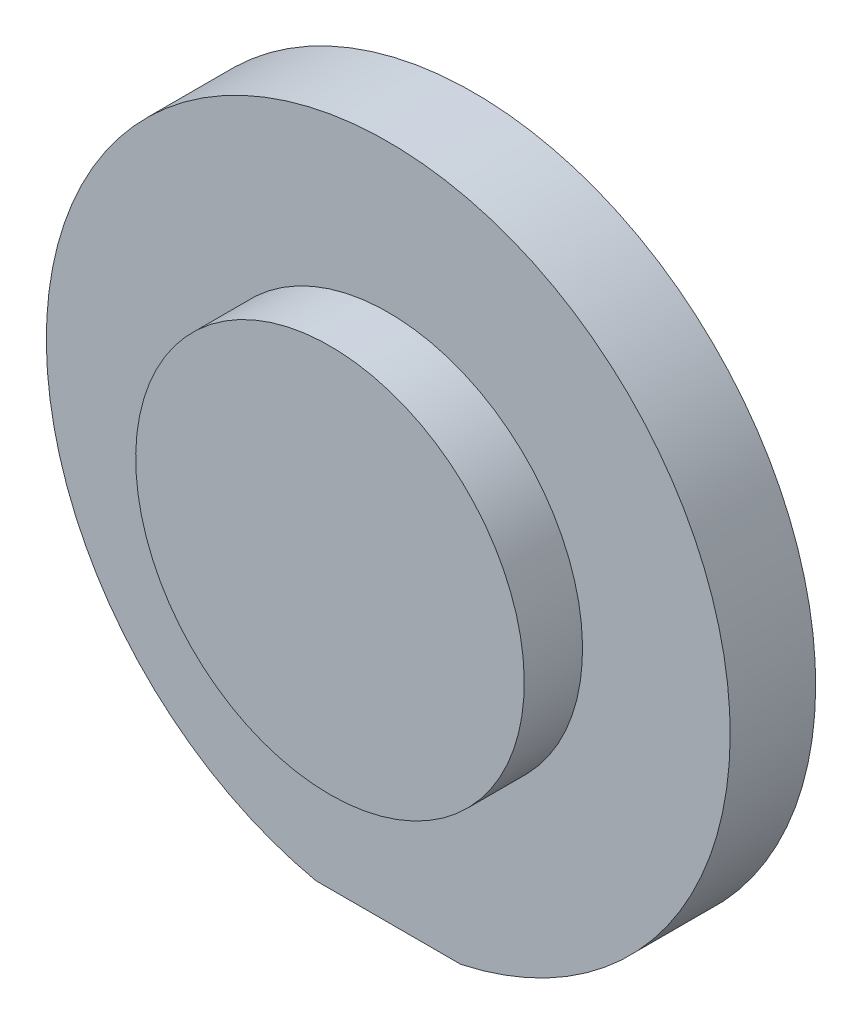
ISO-10303-21;
HEADER;
FILE_DESCRIPTION(('STEP AP214'),'2;1');
FILE_NAME('part.step','',(''),(''),'','','');
FILE_SCHEMA(('AUTOMOTIVE_DESIGN { 1 0 10303 214 1 1 1 1 }'));
ENDSEC;
DATA;
#1=APPLICATION_CONTEXT('core data for automotive mechanical design processes');
#2=APPLICATION_PROTOCOL_DEFINITION('international standard','automotive_design',2000,#1);
#3=PRODUCT_CONTEXT('',#1,'mechanical');
#4=PRODUCT('Part','Part','',(#3));
#5=PRODUCT_RELATED_PRODUCT_CATEGORY('part','',(#4));
#6=PRODUCT_DEFINITION_FORMATION('','',#4);
#7=PRODUCT_DEFINITION_CONTEXT('part definition',#1,'design');
#8=PRODUCT_DEFINITION('design','',#6,#7);
#9=PRODUCT_DEFINITION_SHAPE('','',#8);
#10=(LENGTH_UNIT() NAMED_UNIT(*) SI_UNIT(.MILLI.,.METRE.));
#11=(NAMED_UNIT(*) PLANE_ANGLE_UNIT() SI_UNIT($,.RADIAN.));
#12=(NAMED_UNIT(*) SI_UNIT($,.STERADIAN.) SOLID_ANGLE_UNIT());
#13=UNCERTAINTY_MEASURE_WITH_UNIT(LENGTH_MEASURE(1.E-05),#10,'distance_accuracy_value','');
#14=(GEOMETRIC_REPRESENTATION_CONTEXT(3) GLOBAL_UNCERTAINTY_ASSIGNED_CONTEXT((#13)) GLOBAL_UNIT_ASSIGNED_CONTEXT((#10,
#11,#12)) REPRESENTATION_CONTEXT('',''));
#15=CARTESIAN_POINT('',(0.,0.,0.));
#16=DIRECTION('',(0.,0.,1.));
#17=DIRECTION('',(1.,0.,0.));
#18=AXIS2_PLACEMENT_3D('',#15,#16,#17);
#19=CARTESIAN_POINT('',(2.27373675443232E-13,1.24761854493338E-13,-4.54747350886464E-13));
#20=DIRECTION('',(0.,0.,-1.));
#21=DIRECTION('',(0.,1.,0.));
#22=AXIS2_PLACEMENT_3D('',#19,#20,#21);
#23=PLANE('',#22);
#24=CARTESIAN_POINT('',(2.2903900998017E-13,1.24761854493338E-13,-4.55364912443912E-13));
#25=DIRECTION('',(0.,0.,1.));
#26=DIRECTION('',(0.,-1.,0.));
#27=AXIS2_PLACEMENT_3D('',#24,#25,#26);
#28=CIRCLE('',#27,25.);
#29=CARTESIAN_POINT('',(2.2903900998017E-13,-24.9999999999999,-4.41201166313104E-13));
#30=VERTEX_POINT('',#29);
#31=EDGE_CURVE('E19',#30,#30,#28,.F.);
#32=ORIENTED_EDGE('',*,*,#31,.F.);
#33=EDGE_LOOP('',(#32));
#34=FACE_BOUND('',#33,.T.);
#35=ADVANCED_FACE('F16',(#34),#23,.F.);
#36=CARTESIAN_POINT('',(2.27373675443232E-13,1.20512730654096E-13,-7.50000000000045));
#37=DIRECTION('',(0.,0.,1.));
#38=DIRECTION('',(0.,-1.,0.));
#39=AXIS2_PLACEMENT_3D('',#36,#37,#38);
#40=CYLINDRICAL_SURFACE('',#39,25.);
#41=ORIENTED_EDGE('',*,*,#31,.T.);
#42=EDGE_LOOP('',(#41));
#43=FACE_BOUND('',#42,.T.);
#44=CARTESIAN_POINT('',(2.27373675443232E-13,1.20512730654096E-13,-7.50000000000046));
#45=DIRECTION('',(0.,0.,1.));
#46=DIRECTION('',(0.,-1.,0.));
#47=AXIS2_PLACEMENT_3D('',#44,#45,#46);
#48=CIRCLE('',#47,25.);
#49=CARTESIAN_POINT('',(2.27373675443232E-13,-24.9999999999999,-7.50000000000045));
#50=VERTEX_POINT('',#49);
#51=EDGE_CURVE('E50',#50,#50,#48,.F.);
#52=ORIENTED_EDGE('',*,*,#51,.F.);
#53=EDGE_LOOP('',(#52));
#54=FACE_BOUND('',#53,.T.);
#55=ADVANCED_FACE('F64',(#43,#54),#40,.T.);
#56=CARTESIAN_POINT('',(2.27373675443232E-13,-3.92533270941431,-7.50000000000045));
#57=DIRECTION('',(0.,0.,1.));
#58=DIRECTION('',(0.,-1.,0.));
#59=AXIS2_PLACEMENT_3D('',#56,#57,#58);
#60=PLANE('',#59);
#61=CARTESIAN_POINT('',(2.29816166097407E-13,1.20512730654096E-13,-7.50000000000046));
#62=DIRECTION('',(0.,0.,1.));
#63=DIRECTION('',(0.,-1.,0.));
#64=AXIS2_PLACEMENT_3D('',#61,#62,#63);
#65=CIRCLE('',#64,44.);
#66=CARTESIAN_POINT('',(-9.32737905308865,-42.9999999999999,-7.50000000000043));
#67=VERTEX_POINT('',#66);
#68=CARTESIAN_POINT('',(9.3273790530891,-42.9999999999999,-7.50000000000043));
#69=VERTEX_POINT('',#68);
#70=EDGE_CURVE('E45',#67,#69,#65,.F.);
#71=ORIENTED_EDGE('',*,*,#70,.F.);
#72=DIRECTION('',(1.,0.,0.));
#73=VECTOR('',#72,1.);
#74=CARTESIAN_POINT('',(9.32737905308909,-42.9999999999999,-7.50000000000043));
#75=LINE('',#74,#73);
#76=EDGE_CURVE('E40',#69,#67,#75,.F.);
#77=ORIENTED_EDGE('',*,*,#76,.F.);
#78=EDGE_LOOP('',(#71,#77));
#79=FACE_BOUND('',#78,.T.);
#80=ORIENTED_EDGE('',*,*,#51,.T.);
#81=EDGE_LOOP('',(#80));
#82=FACE_BOUND('',#81,.T.);
#83=ADVANCED_FACE('F54',(#79,#82),#60,.T.);
#84=CARTESIAN_POINT('',(2.27373675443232E-13,1.1428068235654E-13,-18.5000000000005));
#85=DIRECTION('',(0.,0.,1.));
#86=DIRECTION('',(0.,-1.,0.));
#87=AXIS2_PLACEMENT_3D('',#84,#85,#86);
#88=CYLINDRICAL_SURFACE('',#87,44.);
#89=CARTESIAN_POINT('',(2.27373675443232E-13,1.1428068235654E-13,-18.5000000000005));
#90=DIRECTION('',(0.,0.,1.));
#91=DIRECTION('',(0.,-1.,0.));
#92=AXIS2_PLACEMENT_3D('',#89,#90,#91);
#93=CIRCLE('',#92,44.);
#94=CARTESIAN_POINT('',(9.3273790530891,-42.9999999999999,-18.5000000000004));
#95=VERTEX_POINT('',#94);
#96=CARTESIAN_POINT('',(-9.32737905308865,-42.9999999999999,-18.5000000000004));
#97=VERTEX_POINT('',#96);
#98=EDGE_CURVE('E25',#95,#97,#93,.T.);
#99=ORIENTED_EDGE('',*,*,#98,.T.);
#100=DIRECTION('',(0.,0.,-1.));
#101=VECTOR('',#100,1.);
#102=CARTESIAN_POINT('',(-9.32737905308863,-42.9999999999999,-18.5000000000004));
#103=LINE('',#102,#101);
#104=EDGE_CURVE('E33',#67,#97,#103,.T.);
#105=ORIENTED_EDGE('',*,*,#104,.F.);
#106=ORIENTED_EDGE('',*,*,#70,.T.);
#107=DIRECTION('',(0.,0.,-1.));
#108=VECTOR('',#107,1.);
#109=CARTESIAN_POINT('',(9.32737905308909,-42.9999999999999,-18.5000000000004));
#110=LINE('',#109,#108);
#111=EDGE_CURVE('E48',#95,#69,#110,.F.);
#112=ORIENTED_EDGE('',*,*,#111,.F.);
#113=EDGE_LOOP('',(#99,#105,#106,#112));
#114=FACE_BOUND('',#113,.T.);
#115=ADVANCED_FACE('F47',(#114),#88,.T.);
#116=CARTESIAN_POINT('',(9.32737905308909,-42.9999999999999,-18.5000000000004));
#117=DIRECTION('',(0.,-1.,0.));
#118=DIRECTION('',(0.,0.,-1.));
#119=AXIS2_PLACEMENT_3D('',#116,#117,#118);
#120=PLANE('',#119);
#121=DIRECTION('',(1.,0.,0.));
#122=VECTOR('',#121,1.);
#123=CARTESIAN_POINT('',(2.27373675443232E-13,-42.9999999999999,-18.5000000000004));
#124=LINE('',#123,#122);
#125=EDGE_CURVE('E10',#97,#95,#124,.T.);
#126=ORIENTED_EDGE('',*,*,#125,.T.);
#127=ORIENTED_EDGE('',*,*,#111,.T.);
#128=ORIENTED_EDGE('',*,*,#76,.T.);
#129=ORIENTED_EDGE('',*,*,#104,.T.);
#130=EDGE_LOOP('',(#126,#127,#128,#129));
#131=FACE_BOUND('',#130,.T.);
#132=ADVANCED_FACE('F52',(#131),#120,.T.);
#133=CARTESIAN_POINT('',(2.27373675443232E-13,-3.92533270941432,-18.5000000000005));
#134=DIRECTION('',(0.,0.,1.));
#135=DIRECTION('',(0.,-1.,0.));
#136=AXIS2_PLACEMENT_3D('',#133,#134,#135);
#137=PLANE('',#136);
#138=ORIENTED_EDGE('',*,*,#98,.F.);
#139=ORIENTED_EDGE('',*,*,#125,.F.);
#140=EDGE_LOOP('',(#138,#139));
#141=FACE_BOUND('',#140,.T.);
#142=ADVANCED_FACE('F72',(#141),#137,.F.);
#143=CLOSED_SHELL('',(#35,#55,#83,#115,#132,#142));
#144=MANIFOLD_SOLID_BREP('B1',#143);
#145=ADVANCED_BREP_SHAPE_REPRESENTATION('',(#18,#144),#14);
#146=SHAPE_DEFINITION_REPRESENTATION(#9,#145);
ENDSEC;
END-ISO-10303-21;
